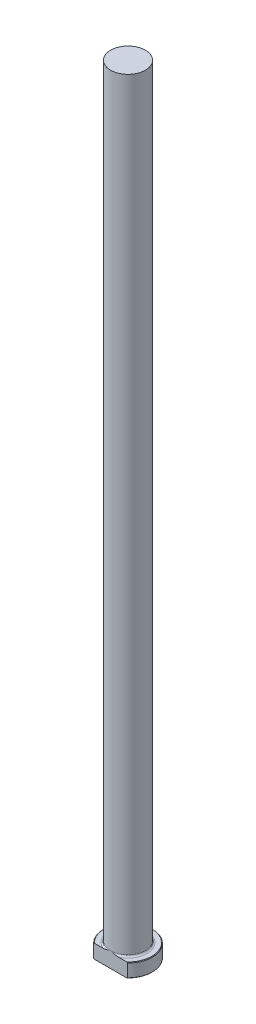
ISO-10303-21;
HEADER;
FILE_DESCRIPTION(('STEP AP214'),'2;1');
FILE_NAME('part.step','',(''),(''),'','','');
FILE_SCHEMA(('AUTOMOTIVE_DESIGN { 1 0 10303 214 1 1 1 1 }'));
ENDSEC;
DATA;
#1=APPLICATION_CONTEXT('core data for automotive mechanical design processes');
#2=APPLICATION_PROTOCOL_DEFINITION('international standard','automotive_design',2000,#1);
#3=PRODUCT_CONTEXT('',#1,'mechanical');
#4=PRODUCT('Part','Part','',(#3));
#5=PRODUCT_RELATED_PRODUCT_CATEGORY('part','',(#4));
#6=PRODUCT_DEFINITION_FORMATION('','',#4);
#7=PRODUCT_DEFINITION_CONTEXT('part definition',#1,'design');
#8=PRODUCT_DEFINITION('design','',#6,#7);
#9=PRODUCT_DEFINITION_SHAPE('','',#8);
#10=(LENGTH_UNIT() NAMED_UNIT(*) SI_UNIT(.MILLI.,.METRE.));
#11=(NAMED_UNIT(*) PLANE_ANGLE_UNIT() SI_UNIT($,.RADIAN.));
#12=(NAMED_UNIT(*) SI_UNIT($,.STERADIAN.) SOLID_ANGLE_UNIT());
#13=UNCERTAINTY_MEASURE_WITH_UNIT(LENGTH_MEASURE(1.E-05),#10,'distance_accuracy_value','');
#14=(GEOMETRIC_REPRESENTATION_CONTEXT(3) GLOBAL_UNCERTAINTY_ASSIGNED_CONTEXT((#13)) GLOBAL_UNIT_ASSIGNED_CONTEXT((#10,
#11,#12)) REPRESENTATION_CONTEXT('',''));
#15=CARTESIAN_POINT('',(0.,0.,0.));
#16=DIRECTION('',(0.,0.,1.));
#17=DIRECTION('',(1.,0.,0.));
#18=AXIS2_PLACEMENT_3D('',#15,#16,#17);
#19=CARTESIAN_POINT('',(0.,0.,0.));
#20=DIRECTION('',(0.,-1.,0.));
#21=DIRECTION('',(0.,0.,-1.));
#22=AXIS2_PLACEMENT_3D('',#19,#20,#21);
#23=PLANE('',#22);
#24=DIRECTION('',(1.,0.,0.));
#25=VECTOR('',#24,1.);
#26=CARTESIAN_POINT('',(-7.77712993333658,0.,7.93749999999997));
#27=LINE('',#26,#25);
#28=CARTESIAN_POINT('',(-7.40966369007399,0.,7.93749999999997));
#29=VERTEX_POINT('',#28);
#30=CARTESIAN_POINT('',(7.40966369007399,0.,7.93749999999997));
#31=VERTEX_POINT('',#30);
#32=EDGE_CURVE('E92',#29,#31,#27,.T.);
#33=ORIENTED_EDGE('',*,*,#32,.F.);
#34=CARTESIAN_POINT('',(0.,0.,0.));
#35=DIRECTION('',(0.,-1.,0.));
#36=DIRECTION('',(0.,0.,-1.));
#37=AXIS2_PLACEMENT_3D('',#34,#35,#36);
#38=CIRCLE('',#37,10.8585);
#39=EDGE_CURVE('E105',#29,#31,#38,.T.);
#40=ORIENTED_EDGE('',*,*,#39,.T.);
#41=EDGE_LOOP('',(#33,#40));
#42=FACE_BOUND('',#41,.T.);
#43=ADVANCED_FACE('F37',(#42),#23,.T.);
#44=CARTESIAN_POINT('',(0.,259.958771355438,0.));
#45=DIRECTION('',(0.,1.,0.));
#46=DIRECTION('',(0.,0.,1.));
#47=AXIS2_PLACEMENT_3D('',#44,#45,#46);
#48=CYLINDRICAL_SURFACE('',#47,11.1125);
#49=DIRECTION('',(0.,-1.,0.));
#50=VECTOR('',#49,1.);
#51=CARTESIAN_POINT('',(-7.77712993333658,355.6,7.93749999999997));
#52=LINE('',#51,#50);
#53=CARTESIAN_POINT('',(-7.77712993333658,6.09599999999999,7.93749999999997));
#54=VERTEX_POINT('',#53);
#55=CARTESIAN_POINT('',(-7.77712993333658,0.253999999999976,7.93749999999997));
#56=VERTEX_POINT('',#55);
#57=EDGE_CURVE('E95',#54,#56,#52,.T.);
#58=ORIENTED_EDGE('',*,*,#57,.F.);
#59=CARTESIAN_POINT('',(0.,6.09599999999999,0.));
#60=DIRECTION('',(0.,1.,0.));
#61=DIRECTION('',(0.,0.,1.));
#62=AXIS2_PLACEMENT_3D('',#59,#60,#61);
#63=CIRCLE('',#62,11.1125);
#64=CARTESIAN_POINT('',(7.77712993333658,6.09599999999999,7.93749999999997));
#65=VERTEX_POINT('',#64);
#66=EDGE_CURVE('E109',#54,#65,#63,.F.);
#67=ORIENTED_EDGE('',*,*,#66,.T.);
#68=DIRECTION('',(0.,-1.,0.));
#69=VECTOR('',#68,1.);
#70=CARTESIAN_POINT('',(7.77712993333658,355.6,7.93749999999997));
#71=LINE('',#70,#69);
#72=CARTESIAN_POINT('',(7.77712993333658,0.253999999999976,7.93749999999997));
#73=VERTEX_POINT('',#72);
#74=EDGE_CURVE('E187',#65,#73,#71,.T.);
#75=ORIENTED_EDGE('',*,*,#74,.T.);
#76=CARTESIAN_POINT('',(0.,0.253999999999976,0.));
#77=DIRECTION('',(0.,-1.,0.));
#78=DIRECTION('',(0.,0.,-1.));
#79=AXIS2_PLACEMENT_3D('',#76,#77,#78);
#80=CIRCLE('',#79,11.1125);
#81=EDGE_CURVE('E115',#73,#56,#80,.F.);
#82=ORIENTED_EDGE('',*,*,#81,.T.);
#83=EDGE_LOOP('',(#58,#67,#75,#82));
#84=FACE_BOUND('',#83,.T.);
#85=ADVANCED_FACE('F160',(#84),#48,.T.);
#86=CARTESIAN_POINT('',(-11.1125,6.35,0.));
#87=DIRECTION('',(0.,1.,0.));
#88=DIRECTION('',(0.,0.,1.));
#89=AXIS2_PLACEMENT_3D('',#86,#87,#88);
#90=PLANE('',#89);
#91=DIRECTION('',(-1.,0.,0.));
#92=VECTOR('',#91,1.);
#93=CARTESIAN_POINT('',(-11.1125,6.35,7.93749999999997));
#94=LINE('',#93,#92);
#95=CARTESIAN_POINT('',(7.40966369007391,6.35,7.93749999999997));
#96=VERTEX_POINT('',#95);
#97=CARTESIAN_POINT('',(3.56053282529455,6.35,7.93749999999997));
#98=VERTEX_POINT('',#97);
#99=EDGE_CURVE('E58',#96,#98,#94,.T.);
#100=ORIENTED_EDGE('',*,*,#99,.F.);
#101=CARTESIAN_POINT('',(0.,6.35,0.));
#102=DIRECTION('',(0.,1.,0.));
#103=DIRECTION('',(0.,0.,1.));
#104=AXIS2_PLACEMENT_3D('',#101,#102,#103);
#105=CIRCLE('',#104,10.8585);
#106=CARTESIAN_POINT('',(-7.40966369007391,6.35,7.93749999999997));
#107=VERTEX_POINT('',#106);
#108=EDGE_CURVE('E182',#96,#107,#105,.T.);
#109=ORIENTED_EDGE('',*,*,#108,.T.);
#110=CARTESIAN_POINT('',(-3.56053282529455,6.35000000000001,7.93749999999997));
#111=VERTEX_POINT('',#110);
#112=EDGE_CURVE('E140',#111,#107,#94,.T.);
#113=ORIENTED_EDGE('',*,*,#112,.F.);
#114=CARTESIAN_POINT('',(0.,6.35,0.));
#115=DIRECTION('',(0.,1.,0.));
#116=DIRECTION('',(0.,0.,1.));
#117=AXIS2_PLACEMENT_3D('',#114,#115,#116);
#118=CIRCLE('',#117,8.69949999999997);
#119=EDGE_CURVE('E112',#111,#98,#118,.F.);
#120=ORIENTED_EDGE('',*,*,#119,.T.);
#121=EDGE_LOOP('',(#100,#109,#113,#120));
#122=FACE_BOUND('',#121,.T.);
#123=ADVANCED_FACE('F164',(#122),#90,.T.);
#124=CARTESIAN_POINT('',(0.,259.958771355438,0.));
#125=DIRECTION('',(0.,1.,0.));
#126=DIRECTION('',(0.,0.,1.));
#127=AXIS2_PLACEMENT_3D('',#124,#125,#126);
#128=CYLINDRICAL_SURFACE('',#127,7.93749999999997);
#129=CARTESIAN_POINT('',(0.,7.11200000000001,0.));
#130=DIRECTION('',(0.,1.,0.));
#131=DIRECTION('',(0.,0.,1.));
#132=AXIS2_PLACEMENT_3D('',#129,#130,#131);
#133=CIRCLE('',#132,7.93749999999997);
#134=CARTESIAN_POINT('',(0.,7.11200000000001,7.93749999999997));
#135=VERTEX_POINT('',#134);
#136=EDGE_CURVE('E108',#135,#135,#133,.T.);
#137=ORIENTED_EDGE('',*,*,#136,.T.);
#138=EDGE_LOOP('',(#137));
#139=FACE_BOUND('',#138,.T.);
#140=CARTESIAN_POINT('',(0.,355.6,0.));
#141=DIRECTION('',(0.,1.,0.));
#142=DIRECTION('',(0.,0.,1.));
#143=AXIS2_PLACEMENT_3D('',#140,#141,#142);
#144=CIRCLE('',#143,7.93749999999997);
#145=CARTESIAN_POINT('',(0.,355.6,7.93749999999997));
#146=VERTEX_POINT('',#145);
#147=EDGE_CURVE('E100',#146,#146,#144,.T.);
#148=ORIENTED_EDGE('',*,*,#147,.F.);
#149=EDGE_LOOP('',(#148));
#150=FACE_BOUND('',#149,.T.);
#151=ADVANCED_FACE('F169',(#139,#150),#128,.T.);
#152=CARTESIAN_POINT('',(-7.93749999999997,355.6,0.));
#153=DIRECTION('',(0.,1.,0.));
#154=DIRECTION('',(0.,0.,1.));
#155=AXIS2_PLACEMENT_3D('',#152,#153,#154);
#156=PLANE('',#155);
#157=ORIENTED_EDGE('',*,*,#147,.T.);
#158=EDGE_LOOP('',(#157));
#159=FACE_BOUND('',#158,.T.);
#160=ADVANCED_FACE('F127',(#159),#156,.T.);
#161=CARTESIAN_POINT('',(0.,6.35000000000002,0.));
#162=DIRECTION('',(0.,-1.,0.));
#163=DIRECTION('',(0.,0.,-1.));
#164=AXIS2_PLACEMENT_3D('',#161,#162,#163);
#165=CONICAL_SURFACE('',#164,10.8584999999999,0.785398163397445);
#166=CARTESIAN_POINT('',(7.77782993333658,6.09551009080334,7.93749999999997));
#167=CARTESIAN_POINT('',(7.55686416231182,6.25010918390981,7.93749999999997));
#168=CARTESIAN_POINT('',(7.33434137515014,6.40253625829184,7.93749999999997));
#169=CARTESIAN_POINT('',(6.88555157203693,6.7020030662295,7.93749999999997));
#170=CARTESIAN_POINT('',(6.65928281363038,6.84904018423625,7.93749999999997));
#171=CARTESIAN_POINT('',(6.19963219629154,7.13839015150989,7.93749999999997));
#172=CARTESIAN_POINT('',(5.96619621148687,7.28061745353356,7.93749999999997));
#173=CARTESIAN_POINT('',(5.49446343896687,7.55674147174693,7.93749999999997));
#174=CARTESIAN_POINT('',(5.25616724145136,7.69063919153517,7.93749999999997));
#175=CARTESIAN_POINT('',(4.76752037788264,7.9516462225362,7.93749999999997));
#176=CARTESIAN_POINT('',(4.51701802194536,8.07847357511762,7.93749999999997));
#177=CARTESIAN_POINT('',(4.00950327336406,8.31861548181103,7.93749999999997));
#178=CARTESIAN_POINT('',(3.7524896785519,8.43192751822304,7.93749999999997));
#179=CARTESIAN_POINT('',(3.23293213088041,8.64114728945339,7.93749999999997));
#180=CARTESIAN_POINT('',(2.9704233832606,8.73714146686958,7.93749999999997));
#181=CARTESIAN_POINT('',(2.43885877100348,8.90857479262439,7.93749999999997));
#182=CARTESIAN_POINT('',(2.16980716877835,8.98402695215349,7.93749999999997));
#183=CARTESIAN_POINT('',(1.63948909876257,9.10734340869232,7.93749999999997));
#184=CARTESIAN_POINT('',(1.37850272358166,9.15639501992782,7.93749999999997));
#185=CARTESIAN_POINT('',(0.852916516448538,9.22954584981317,7.93749999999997));
#186=CARTESIAN_POINT('',(0.588315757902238,9.25363854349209,7.93749999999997));
#187=CARTESIAN_POINT('',(0.0615241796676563,9.27506688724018,7.93749999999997));
#188=CARTESIAN_POINT('',(-0.200652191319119,9.27275242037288,7.93749999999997));
#189=CARTESIAN_POINT('',(-0.723483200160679,9.24237186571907,7.93749999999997));
#190=CARTESIAN_POINT('',(-0.984137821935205,9.21430550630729,7.93749999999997));
#191=CARTESIAN_POINT('',(-1.49971239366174,9.13455414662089,7.93749999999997));
#192=CARTESIAN_POINT('',(-1.75466085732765,9.08305007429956,7.93749999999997));
#193=CARTESIAN_POINT('',(-2.25943125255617,8.95931831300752,7.93749999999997));
#194=CARTESIAN_POINT('',(-2.50925257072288,8.88708815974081,7.93749999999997));
#195=CARTESIAN_POINT('',(-3.00607435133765,8.72412572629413,7.93749999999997));
#196=CARTESIAN_POINT('',(-3.25300380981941,8.63317958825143,7.93749999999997));
#197=CARTESIAN_POINT('',(-3.74082952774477,8.43650564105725,7.93749999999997));
#198=CARTESIAN_POINT('',(-3.98172592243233,8.33077816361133,7.93749999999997));
#199=CARTESIAN_POINT('',(-4.5370759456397,8.07009959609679,7.93749999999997));
#200=CARTESIAN_POINT('',(-4.84932653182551,7.91047736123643,7.93749999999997));
#201=CARTESIAN_POINT('',(-5.4650687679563,7.57500459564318,7.93749999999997));
#202=CARTESIAN_POINT('',(-5.76855592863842,7.39914593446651,7.93749999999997));
#203=CARTESIAN_POINT('',(-6.3598067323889,7.04004732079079,7.93749999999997));
#204=CARTESIAN_POINT('',(-6.64777344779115,6.85713981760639,7.93749999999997));
#205=CARTESIAN_POINT('',(-7.0749988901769,6.57609320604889,7.93749999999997));
#206=CARTESIAN_POINT('',(-7.21652251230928,6.48136542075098,7.93749999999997));
#207=CARTESIAN_POINT('',(-7.49818193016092,6.28989246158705,7.93749999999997));
#208=CARTESIAN_POINT('',(-7.63831784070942,6.19314745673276,7.93749999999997));
#209=CARTESIAN_POINT('',(-7.77782993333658,6.09551009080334,7.93749999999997));
#210=B_SPLINE_CURVE_WITH_KNOTS('',3,(#166,#167,#168,#169,#170,#171,#172,#173,#174,#175,#176,
#177,#178,#179,#180,#181,#182,#183,#184,#185,#186,#187,#188,#189,#190,#191,#192,#193,#194,#195,
#196,#197,#198,#199,#200,#201,#202,#203,#204,#205,#206,#207,#208,#209),.UNSPECIFIED.,.F.,.F.,(4,
2,2,2,2,2,2,2,2,2,2,2,2,2,2,2,2,2,2,2,2,4),(0.,0.809069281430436,1.61852611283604,
2.43843783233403,3.2582505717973,4.10026020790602,4.94242645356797,5.7802650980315,
6.61757181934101,7.41315717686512,8.20895047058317,8.99421223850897,9.77948228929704,
10.5587906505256,11.3381917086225,12.1270494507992,12.9158894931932,13.9672755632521,
15.0191910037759,16.042396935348,16.5532851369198,17.0641307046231),.UNSPECIFIED.);
#211=EDGE_CURVE('E63',#65,#96,#210,.T.);
#212=ORIENTED_EDGE('',*,*,#211,.F.);
#213=ORIENTED_EDGE('',*,*,#66,.F.);
#214=EDGE_CURVE('E133',#107,#54,#210,.T.);
#215=ORIENTED_EDGE('',*,*,#214,.F.);
#216=ORIENTED_EDGE('',*,*,#108,.F.);
#217=EDGE_LOOP('',(#212,#213,#215,#216));
#218=FACE_BOUND('',#217,.T.);
#219=ADVANCED_FACE('F147',(#218),#165,.T.);
#220=CARTESIAN_POINT('',(0.,0.253999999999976,0.));
#221=DIRECTION('',(0.,1.,0.));
#222=DIRECTION('',(0.,0.,1.));
#223=AXIS2_PLACEMENT_3D('',#220,#221,#222);
#224=CONICAL_SURFACE('',#223,11.1125,0.78539816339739);
#225=CARTESIAN_POINT('',(-7.77782993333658,0.254489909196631,7.93749999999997));
#226=CARTESIAN_POINT('',(-7.55686416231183,0.0998908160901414,7.93749999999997));
#227=CARTESIAN_POINT('',(-7.33434137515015,-0.0525362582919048,7.93749999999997));
#228=CARTESIAN_POINT('',(-6.88555157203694,-0.352003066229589,7.93749999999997));
#229=CARTESIAN_POINT('',(-6.6592828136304,-0.499040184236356,7.93749999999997));
#230=CARTESIAN_POINT('',(-6.19963219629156,-0.78839015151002,7.93749999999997));
#231=CARTESIAN_POINT('',(-5.9661962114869,-0.93061745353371,7.93749999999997));
#232=CARTESIAN_POINT('',(-5.4944634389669,-1.2067414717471,7.93749999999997));
#233=CARTESIAN_POINT('',(-5.25616724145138,-1.34063919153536,7.93749999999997));
#234=CARTESIAN_POINT('',(-4.76752037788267,-1.60164622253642,7.93749999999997));
#235=CARTESIAN_POINT('',(-4.51701802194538,-1.72847357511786,7.93749999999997));
#236=CARTESIAN_POINT('',(-4.00950327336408,-1.96861548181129,7.93749999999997));
#237=CARTESIAN_POINT('',(-3.75248967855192,-2.08192751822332,7.93749999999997));
#238=CARTESIAN_POINT('',(-3.23293213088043,-2.2911472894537,7.93749999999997));
#239=CARTESIAN_POINT('',(-2.97042338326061,-2.3871414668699,7.93749999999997));
#240=CARTESIAN_POINT('',(-2.43885877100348,-2.55857479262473,7.93749999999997));
#241=CARTESIAN_POINT('',(-2.16980716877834,-2.63402695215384,7.93749999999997));
#242=CARTESIAN_POINT('',(-1.63948909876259,-2.75734340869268,7.93749999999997));
#243=CARTESIAN_POINT('',(-1.37850272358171,-2.80639501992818,7.93749999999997));
#244=CARTESIAN_POINT('',(-0.852916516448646,-2.87954584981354,7.93749999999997));
#245=CARTESIAN_POINT('',(-0.588315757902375,-2.90363854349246,7.93749999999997));
#246=CARTESIAN_POINT('',(-0.0615241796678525,-2.92506688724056,7.93749999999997));
#247=CARTESIAN_POINT('',(0.200652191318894,-2.92275242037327,7.93749999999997));
#248=CARTESIAN_POINT('',(0.723483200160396,-2.89237186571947,7.93749999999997));
#249=CARTESIAN_POINT('',(0.984137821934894,-2.8643055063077,7.93749999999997));
#250=CARTESIAN_POINT('',(1.49971239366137,-2.78455414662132,7.93749999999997));
#251=CARTESIAN_POINT('',(1.75466085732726,-2.7330500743,7.93749999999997));
#252=CARTESIAN_POINT('',(2.25943125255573,-2.60931831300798,7.93749999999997));
#253=CARTESIAN_POINT('',(2.50925257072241,-2.53708815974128,7.93749999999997));
#254=CARTESIAN_POINT('',(3.00607435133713,-2.37412572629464,7.93749999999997));
#255=CARTESIAN_POINT('',(3.25300380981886,-2.28317958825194,7.93749999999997));
#256=CARTESIAN_POINT('',(3.74082952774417,-2.0865056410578,7.93749999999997));
#257=CARTESIAN_POINT('',(3.98172592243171,-1.98077816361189,7.93749999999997));
#258=CARTESIAN_POINT('',(4.53707594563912,-1.72009959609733,7.93749999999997));
#259=CARTESIAN_POINT('',(4.849326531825,-1.56047736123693,7.93749999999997));
#260=CARTESIAN_POINT('',(5.4650687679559,-1.2250045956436,7.93749999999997));
#261=CARTESIAN_POINT('',(5.76855592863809,-1.04914593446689,7.93749999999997));
#262=CARTESIAN_POINT('',(6.35980673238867,-0.690047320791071,7.93749999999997));
#263=CARTESIAN_POINT('',(6.64777344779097,-0.507139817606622,7.93749999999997));
#264=CARTESIAN_POINT('',(7.07499889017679,-0.22609320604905,7.93749999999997));
#265=CARTESIAN_POINT('',(7.21652251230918,-0.13136542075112,7.93749999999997));
#266=CARTESIAN_POINT('',(7.49818193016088,0.0601075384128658,7.93749999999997));
#267=CARTESIAN_POINT('',(7.6383178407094,0.156852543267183,7.93749999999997));
#268=CARTESIAN_POINT('',(7.77782993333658,0.254489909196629,7.93749999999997));
#269=B_SPLINE_CURVE_WITH_KNOTS('',3,(#225,#226,#227,#228,#229,#230,#231,#232,#233,#234,#235,
#236,#237,#238,#239,#240,#241,#242,#243,#244,#245,#246,#247,#248,#249,#250,#251,#252,#253,#254,
#255,#256,#257,#258,#259,#260,#261,#262,#263,#264,#265,#266,#267,#268),.UNSPECIFIED.,.F.,.F.,(4,
2,2,2,2,2,2,2,2,2,2,2,2,2,2,2,2,2,2,2,2,4),(0.,0.809069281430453,1.61852611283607,
2.43843783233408,3.25825057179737,4.10026020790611,4.94242645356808,5.78026509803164,
6.61757181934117,7.41315717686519,8.20895047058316,8.99421223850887,9.77948228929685,
10.5587906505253,11.3381917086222,12.1270494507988,12.9158894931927,13.9672755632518,
15.0191910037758,16.0423969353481,16.55328513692,17.0641307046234),.UNSPECIFIED.);
#270=EDGE_CURVE('E89',#56,#29,#269,.T.);
#271=ORIENTED_EDGE('',*,*,#270,.F.);
#272=ORIENTED_EDGE('',*,*,#81,.F.);
#273=EDGE_CURVE('E101',#31,#73,#269,.T.);
#274=ORIENTED_EDGE('',*,*,#273,.F.);
#275=ORIENTED_EDGE('',*,*,#39,.F.);
#276=EDGE_LOOP('',(#271,#272,#274,#275));
#277=FACE_BOUND('',#276,.T.);
#278=ADVANCED_FACE('F107',(#277),#224,.T.);
#279=CARTESIAN_POINT('',(0.,7.11200000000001,0.));
#280=DIRECTION('',(0.,1.,0.));
#281=DIRECTION('',(0.,0.,1.));
#282=AXIS2_PLACEMENT_3D('',#279,#280,#281);
#283=TOROIDAL_SURFACE('',#282,8.69949999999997,0.762);
#284=ORIENTED_EDGE('',*,*,#119,.F.);
#285=CARTESIAN_POINT('',(0.,7.11200000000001,7.93749999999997));
#286=CARTESIAN_POINT('',(1.13258152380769E-10,7.11200098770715,7.93749999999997));
#287=CARTESIAN_POINT('',(-2.94116963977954E-07,7.11200197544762,7.93749999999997));
#288=CARTESIAN_POINT('',(-1.16076455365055E-06,7.11200384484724,7.93749999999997));
#289=CARTESIAN_POINT('',(-1.74846185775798E-06,7.11200471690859,7.93749999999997));
#290=CARTESIAN_POINT('',(-3.15168242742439E-06,7.11200648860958,7.93749999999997));
#291=CARTESIAN_POINT('',(-3.98838294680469E-06,7.11200737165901,7.93749999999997));
#292=CARTESIAN_POINT('',(-5.75414916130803E-06,7.11200899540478,7.93749999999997));
#293=CARTESIAN_POINT('',(-6.68112169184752E-06,7.11200973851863,7.93749999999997));
#294=CARTESIAN_POINT('',(-1.01485822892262E-05,7.11201237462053,7.93749999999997));
#295=CARTESIAN_POINT('',(-1.28042082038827E-05,7.11201412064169,7.93749999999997));
#296=CARTESIAN_POINT('',(-1.81630822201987E-05,7.11201710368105,7.93749999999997));
#297=CARTESIAN_POINT('',(-2.08532201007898E-05,7.1120183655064,7.93749999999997));
#298=CARTESIAN_POINT('',(-3.18657482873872E-05,7.1120234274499,7.93749999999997));
#299=CARTESIAN_POINT('',(-4.02765822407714E-05,7.11202705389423,7.93749999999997));
#300=CARTESIAN_POINT('',(-5.64375980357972E-05,7.11203261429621,7.93749999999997));
#301=CARTESIAN_POINT('',(-6.41339918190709E-05,7.1120347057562,7.93749999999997));
#302=CARTESIAN_POINT('',(-0.000120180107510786,7.11204956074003,7.93749999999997));
#303=CARTESIAN_POINT('',(-0.000168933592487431,7.11206045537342,7.93749999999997));
#304=CARTESIAN_POINT('',(-0.000360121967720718,7.11210809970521,7.93749999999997));
#305=CARTESIAN_POINT('',(-0.000500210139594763,7.11215390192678,7.93749999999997));
#306=CARTESIAN_POINT('',(-0.00105170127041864,7.11233078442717,7.93749999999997));
#307=CARTESIAN_POINT('',(-0.00146451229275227,7.11245570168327,7.93749999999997));
#308=CARTESIAN_POINT('',(-0.00309439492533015,7.1129530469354,7.93749999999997));
#309=CARTESIAN_POINT('',(-0.00430970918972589,7.11333301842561,7.93749999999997));
#310=CARTESIAN_POINT('',(-0.00935535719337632,7.11490592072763,7.93749999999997));
#311=CARTESIAN_POINT('',(-0.0131878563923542,7.11608956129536,7.93749999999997));
#312=CARTESIAN_POINT('',(-0.0841146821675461,7.13800088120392,7.93749999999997));
#313=CARTESIAN_POINT('',(-0.151187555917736,7.15882206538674,7.93749999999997));
#314=CARTESIAN_POINT('',(-0.282710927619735,7.1994724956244,7.93749999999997));
#315=CARTESIAN_POINT('',(-0.347159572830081,7.2193082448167,7.93749999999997));
#316=CARTESIAN_POINT('',(-0.484183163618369,7.26126494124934,7.93749999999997));
#317=CARTESIAN_POINT('',(-0.556765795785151,7.28336123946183,7.93749999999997));
#318=CARTESIAN_POINT('',(-0.702843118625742,7.32740310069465,7.93749999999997));
#319=CARTESIAN_POINT('',(-0.77633910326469,7.34934437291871,7.93749999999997));
#320=CARTESIAN_POINT('',(-0.902891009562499,7.38662160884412,7.93749999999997));
#321=CARTESIAN_POINT('',(-0.955908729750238,7.40208704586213,7.93749999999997));
#322=CARTESIAN_POINT('',(-1.06190505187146,7.4326430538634,7.93749999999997));
#323=CARTESIAN_POINT('',(-1.1148834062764,7.44773448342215,7.93749999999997));
#324=CARTESIAN_POINT('',(-1.27145845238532,7.49171323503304,7.93749999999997));
#325=CARTESIAN_POINT('',(-1.37521028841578,7.52005117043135,7.93749999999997));
#326=CARTESIAN_POINT('',(-1.61238875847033,7.58245782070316,7.93749999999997));
#327=CARTESIAN_POINT('',(-1.74598056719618,7.61590602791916,7.93749999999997));
#328=CARTESIAN_POINT('',(-2.01520265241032,7.67878699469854,7.93749999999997));
#329=CARTESIAN_POINT('',(-2.15084070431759,7.70818682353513,7.93749999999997));
#330=CARTESIAN_POINT('',(-2.43325292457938,7.76331762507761,7.93749999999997));
#331=CARTESIAN_POINT('',(-2.58011275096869,7.7886200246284,7.93749999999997));
#332=CARTESIAN_POINT('',(-2.87472585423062,7.83067454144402,7.93749999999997));
#333=CARTESIAN_POINT('',(-3.02247613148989,7.84744708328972,7.93749999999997));
#334=CARTESIAN_POINT('',(-3.31060630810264,7.86923610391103,7.93749999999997));
#335=CARTESIAN_POINT('',(-3.45093460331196,7.87485939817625,7.93749999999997));
#336=CARTESIAN_POINT('',(-3.66050189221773,7.87341982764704,7.93749999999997));
#337=CARTESIAN_POINT('',(-3.72977927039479,7.87133675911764,7.93749999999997));
#338=CARTESIAN_POINT('',(-3.86811371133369,7.86341207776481,7.93749999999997));
#339=CARTESIAN_POINT('',(-3.93717083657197,7.85757164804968,7.93749999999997));
#340=CARTESIAN_POINT('',(-4.06041254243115,7.84314460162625,7.93749999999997));
#341=CARTESIAN_POINT('',(-4.11469322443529,7.83538548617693,7.93749999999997));
#342=CARTESIAN_POINT('',(-4.22269673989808,7.81667130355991,7.93749999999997));
#343=CARTESIAN_POINT('',(-4.27641972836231,7.8057171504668,7.93749999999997));
#344=CARTESIAN_POINT('',(-4.38294358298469,7.78009016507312,7.93749999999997));
#345=CARTESIAN_POINT('',(-4.43574509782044,7.76542007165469,7.93749999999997));
#346=CARTESIAN_POINT('',(-4.5399035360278,7.73168797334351,7.93749999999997));
#347=CARTESIAN_POINT('',(-4.59126184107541,7.7126303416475,7.93749999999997));
#348=CARTESIAN_POINT('',(-4.68243097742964,7.67324353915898,7.93749999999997));
#349=CARTESIAN_POINT('',(-4.72262101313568,7.65380111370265,7.93749999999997));
#350=CARTESIAN_POINT('',(-4.80081729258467,7.61075795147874,7.93749999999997));
#351=CARTESIAN_POINT('',(-4.83882094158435,7.5871524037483,7.93749999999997));
#352=CARTESIAN_POINT('',(-4.91185697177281,7.53476777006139,7.93749999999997));
#353=CARTESIAN_POINT('',(-4.94684723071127,7.50592882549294,7.93749999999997));
#354=CARTESIAN_POINT('',(-5.01124850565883,7.44256359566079,7.93749999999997));
#355=CARTESIAN_POINT('',(-5.04068010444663,7.40805921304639,7.93749999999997));
#356=CARTESIAN_POINT('',(-5.08050372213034,7.34868448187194,7.93749999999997));
#357=CARTESIAN_POINT('',(-5.0937376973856,7.32572520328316,7.93749999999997));
#358=CARTESIAN_POINT('',(-5.11643276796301,7.27799728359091,7.93749999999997));
#359=CARTESIAN_POINT('',(-5.12589708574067,7.2532302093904,7.93749999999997));
#360=CARTESIAN_POINT('',(-5.14035194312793,7.20217121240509,7.93749999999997));
#361=CARTESIAN_POINT('',(-5.14530427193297,7.17586823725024,7.93749999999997));
#362=CARTESIAN_POINT('',(-5.15008487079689,7.12280054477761,7.93749999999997));
#363=CARTESIAN_POINT('',(-5.14991589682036,7.096036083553,7.93749999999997));
#364=CARTESIAN_POINT('',(-5.14478044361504,7.04592288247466,7.93749999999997));
#365=CARTESIAN_POINT('',(-5.14033553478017,7.02251814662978,7.93749999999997));
#366=CARTESIAN_POINT('',(-5.12776595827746,6.97672688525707,7.93749999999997));
#367=CARTESIAN_POINT('',(-5.11963963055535,6.95434082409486,7.93749999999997));
#368=CARTESIAN_POINT('',(-5.09700432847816,6.90374425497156,7.93749999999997));
#369=CARTESIAN_POINT('',(-5.08127026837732,6.87608398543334,7.93749999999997));
#370=CARTESIAN_POINT('',(-5.04556418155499,6.82365182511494,7.93749999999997));
#371=CARTESIAN_POINT('',(-5.02558286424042,6.79888645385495,7.93749999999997));
#372=CARTESIAN_POINT('',(-4.97125379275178,6.74000253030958,7.93749999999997));
#373=CARTESIAN_POINT('',(-4.93486414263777,6.70778219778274,7.93749999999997));
#374=CARTESIAN_POINT('',(-4.85771872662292,6.64922291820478,7.93749999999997));
#375=CARTESIAN_POINT('',(-4.81695725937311,6.62289179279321,7.93749999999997));
#376=CARTESIAN_POINT('',(-4.73720517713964,6.57773800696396,7.93749999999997));
#377=CARTESIAN_POINT('',(-4.69849365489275,6.5584128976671,7.93749999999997));
#378=CARTESIAN_POINT('',(-4.61954917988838,6.5231323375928,7.93749999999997));
#379=CARTESIAN_POINT('',(-4.57931497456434,6.50717973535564,7.93749999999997));
#380=CARTESIAN_POINT('',(-4.45647143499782,6.46345758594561,7.93749999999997));
#381=CARTESIAN_POINT('',(-4.37228494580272,6.44011987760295,7.93749999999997));
#382=CARTESIAN_POINT('',(-4.19880968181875,6.4017233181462,7.93749999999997));
#383=CARTESIAN_POINT('',(-4.10944883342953,6.38701466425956,7.93749999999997));
#384=CARTESIAN_POINT('',(-3.92966045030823,6.36518873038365,7.93749999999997));
#385=CARTESIAN_POINT('',(-3.83923113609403,6.35808673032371,7.93749999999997));
#386=CARTESIAN_POINT('',(-3.66108493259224,6.35019088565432,7.93749999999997));
#387=CARTESIAN_POINT('',(-3.57337577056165,6.34919885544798,7.93749999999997));
#388=CARTESIAN_POINT('',(-3.39842026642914,6.35200478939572,7.93749999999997));
#389=CARTESIAN_POINT('',(-3.31117353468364,6.35578253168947,7.93749999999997));
#390=CARTESIAN_POINT('',(-3.10624349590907,6.36936667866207,7.93749999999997));
#391=CARTESIAN_POINT('',(-2.98867206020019,6.38082875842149,7.93749999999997));
#392=CARTESIAN_POINT('',(-2.75430549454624,6.40959217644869,7.93749999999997));
#393=CARTESIAN_POINT('',(-2.63751016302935,6.42689193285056,7.93749999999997));
#394=CARTESIAN_POINT('',(-2.40203457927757,6.46665897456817,7.93749999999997));
#395=CARTESIAN_POINT('',(-2.28337321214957,6.48923652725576,7.93749999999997));
#396=CARTESIAN_POINT('',(-2.0465823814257,6.53840461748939,7.93749999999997));
#397=CARTESIAN_POINT('',(-1.92845502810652,6.5650051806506,7.93749999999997));
#398=CARTESIAN_POINT('',(-1.6507512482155,6.63144067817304,7.93749999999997));
#399=CARTESIAN_POINT('',(-1.49149431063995,6.67260177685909,7.93749999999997));
#400=CARTESIAN_POINT('',(-1.17583354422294,6.75847009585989,7.93749999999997));
#401=CARTESIAN_POINT('',(-1.01941758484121,6.80313344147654,7.93749999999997));
#402=CARTESIAN_POINT('',(-0.794236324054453,6.86935337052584,7.93749999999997));
#403=CARTESIAN_POINT('',(-0.725177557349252,6.88992364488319,7.93749999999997));
#404=CARTESIAN_POINT('',(-0.586877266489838,6.93151983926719,7.93749999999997));
#405=CARTESIAN_POINT('',(-0.517636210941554,6.95254732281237,7.93749999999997));
#406=CARTESIAN_POINT('',(-0.375904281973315,6.99585156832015,7.93749999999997));
#407=CARTESIAN_POINT('',(-0.303416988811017,7.01813983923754,7.93749999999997));
#408=CARTESIAN_POINT('',(-0.159634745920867,7.06256277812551,7.93749999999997));
#409=CARTESIAN_POINT('',(-0.0883389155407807,7.08469437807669,7.93749999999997));
#410=CARTESIAN_POINT('',(-0.0131844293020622,7.10791148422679,7.93749999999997));
#411=CARTESIAN_POINT('',(-0.00934850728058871,7.10909618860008,7.93749999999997));
#412=CARTESIAN_POINT('',(-0.00430206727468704,7.11066934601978,7.93749999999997));
#413=CARTESIAN_POINT('',(-0.0030893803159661,7.1110484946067,7.93749999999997));
#414=CARTESIAN_POINT('',(-0.00146278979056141,7.11154483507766,7.93749999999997));
#415=CARTESIAN_POINT('',(-0.00105063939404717,7.11166955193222,7.93749999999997));
#416=CARTESIAN_POINT('',(-0.000499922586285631,7.11184619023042,7.93749999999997));
#417=CARTESIAN_POINT('',(-0.000359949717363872,7.11189195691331,7.93749999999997));
#418=CARTESIAN_POINT('',(-0.000168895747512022,7.11193956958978,7.93749999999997));
#419=CARTESIAN_POINT('',(-0.000120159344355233,7.11195046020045,7.93749999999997));
#420=CARTESIAN_POINT('',(-6.41304538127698E-05,7.11196530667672,7.93749999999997));
#421=CARTESIAN_POINT('',(-5.64350941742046E-05,7.11196739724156,7.93749999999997));
#422=CARTESIAN_POINT('',(-4.02761206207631E-05,7.1119729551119,7.93749999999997));
#423=CARTESIAN_POINT('',(-3.18662417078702E-05,7.11197657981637,7.93749999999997));
#424=CARTESIAN_POINT('',(-2.08546748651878E-05,7.111981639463,7.93749999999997));
#425=CARTESIAN_POINT('',(-1.81646141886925E-05,7.11198290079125,7.93749999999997));
#426=CARTESIAN_POINT('',(-1.28058054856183E-05,7.11198588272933,7.93749999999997));
#427=CARTESIAN_POINT('',(-1.01501596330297E-05,7.11198762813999,7.93749999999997));
#428=CARTESIAN_POINT('',(-6.68256608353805E-06,7.1119902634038,7.93749999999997));
#429=CARTESIAN_POINT('',(-5.75553210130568E-06,7.11199100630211,7.93749999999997));
#430=CARTESIAN_POINT('',(-3.98960414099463E-06,7.11199262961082,7.93749999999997));
#431=CARTESIAN_POINT('',(-3.15280241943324E-06,7.11199351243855,7.93749999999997));
#432=CARTESIAN_POINT('',(-1.74934054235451E-06,7.11199528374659,7.93749999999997));
#433=CARTESIAN_POINT('',(-1.16151054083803E-06,7.11199615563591,7.93749999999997));
#434=CARTESIAN_POINT('',(-2.9453442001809E-07,7.11199802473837,7.93749999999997));
#435=CARTESIAN_POINT('',(-1.1325131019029E-10,7.11199901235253,7.93749999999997));
#436=CARTESIAN_POINT('',(0.,7.11200000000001,7.93749999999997));
#437=B_SPLINE_CURVE_WITH_KNOTS('',3,(#285,#286,#287,#288,#289,#290,#291,#292,#293,#294,#295,
#296,#297,#298,#299,#300,#301,#302,#303,#304,#305,#306,#307,#308,#309,#310,#311,#312,#313,#314,
#315,#316,#317,#318,#319,#320,#321,#322,#323,#324,#325,#326,#327,#328,#329,#330,#331,#332,#333,
#334,#335,#336,#337,#338,#339,#340,#341,#342,#343,#344,#345,#346,#347,#348,#349,#350,#351,#352,
#353,#354,#355,#356,#357,#358,#359,#360,#361,#362,#363,#364,#365,#366,#367,#368,#369,#370,#371,
#372,#373,#374,#375,#376,#377,#378,#379,#380,#381,#382,#383,#384,#385,#386,#387,#388,#389,#390,
#391,#392,#393,#394,#395,#396,#397,#398,#399,#400,#401,#402,#403,#404,#405,#406,#407,#408,#409,
#410,#411,#412,#413,#414,#415,#416,#417,#418,#419,#420,#421,#422,#423,#424,#425,#426,#427,#428,
#429,#430,#431,#432,#433,#434,#435,#436),.UNSPECIFIED.,.T.,.F.,(4,2,2,2,2,2,2,2,2,2,2,2,2,2,2,2,
2,2,2,2,2,2,2,2,2,2,2,2,2,2,2,2,2,2,2,2,2,2,2,2,2,2,2,2,2,2,2,2,2,2,2,2,2,2,2,2,2,2,2,2,2,2,2,2,
2,2,2,2,2,2,2,2,2,2,2,4),(0.,2.97091136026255E-06,6.11577848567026E-06,9.74697906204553E-06,
1.33081308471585E-05,2.28024387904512E-05,3.17093749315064E-05,5.91235364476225E-05,
8.30186327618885E-05,0.000232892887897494,0.000674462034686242,0.00196893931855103,
0.00578821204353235,0.0178223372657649,0.228503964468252,0.430802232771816,0.658415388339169,
0.888517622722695,1.05419863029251,1.21945534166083,1.54209895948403,1.95519189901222,
2.37146826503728,2.81834547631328,3.26414755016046,3.6849361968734,3.89278379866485,
4.10056598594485,4.26498450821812,4.42935603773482,4.59360676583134,4.75769448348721,
4.89144050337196,5.02534210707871,5.1608847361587,5.29591518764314,5.37514552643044,
5.45430798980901,5.53413479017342,5.61391863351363,5.68506157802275,5.7562366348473,
5.85117093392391,5.94631507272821,6.09131078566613,6.23649794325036,6.36611054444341,
6.49583218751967,6.7571662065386,7.02848031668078,7.30033841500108,7.56332987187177,
7.82521008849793,8.17940150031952,8.53349701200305,8.89578256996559,9.25898631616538,
9.75237330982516,10.2403455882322,10.4565169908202,10.673606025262,10.9011178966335,
11.1250637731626,11.1371086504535,11.1409196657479,11.1422120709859,11.1426532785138,
11.1428031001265,11.1428269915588,11.1428544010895,11.1428633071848,11.142872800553,
11.1428763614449,11.1428799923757,11.1428831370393,11.1428861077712),.UNSPECIFIED.);
#438=EDGE_CURVE('E11',#111,#135,#437,.T.);
#439=ORIENTED_EDGE('',*,*,#438,.T.);
#440=ORIENTED_EDGE('',*,*,#136,.F.);
#441=CARTESIAN_POINT('',(0.,7.11200000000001,7.93749999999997));
#442=CARTESIAN_POINT('',(-1.1325831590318E-10,7.11199901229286,7.93749999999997));
#443=CARTESIAN_POINT('',(2.94116963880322E-07,7.11199802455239,7.93749999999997));
#444=CARTESIAN_POINT('',(1.16076455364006E-06,7.11199615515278,7.93749999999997));
#445=CARTESIAN_POINT('',(1.74846185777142E-06,7.11199528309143,7.93749999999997));
#446=CARTESIAN_POINT('',(3.15168242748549E-06,7.11199351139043,7.93749999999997));
#447=CARTESIAN_POINT('',(3.98838294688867E-06,7.11199262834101,7.93749999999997));
#448=CARTESIAN_POINT('',(5.75414916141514E-06,7.11199100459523,7.93749999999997));
#449=CARTESIAN_POINT('',(6.68112169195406E-06,7.11199026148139,7.93749999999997));
#450=CARTESIAN_POINT('',(1.01485822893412E-05,7.11198762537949,7.93749999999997));
#451=CARTESIAN_POINT('',(1.28042082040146E-05,7.11198587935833,7.93749999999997));
#452=CARTESIAN_POINT('',(1.81630822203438E-05,7.11198289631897,7.93749999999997));
#453=CARTESIAN_POINT('',(2.0853220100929E-05,7.11198163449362,7.93749999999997));
#454=CARTESIAN_POINT('',(3.18657482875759E-05,7.11197657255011,7.93749999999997));
#455=CARTESIAN_POINT('',(4.02765822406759E-05,7.11197294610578,7.93749999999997));
#456=CARTESIAN_POINT('',(5.6437598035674E-05,7.11196738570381,7.93749999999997));
#457=CARTESIAN_POINT('',(6.41339918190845E-05,7.11196529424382,7.93749999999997));
#458=CARTESIAN_POINT('',(0.000120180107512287,7.11195043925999,7.93749999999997));
#459=CARTESIAN_POINT('',(0.000168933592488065,7.1119395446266,7.93749999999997));
#460=CARTESIAN_POINT('',(0.000360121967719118,7.1118919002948,7.93749999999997));
#461=CARTESIAN_POINT('',(0.000500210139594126,7.11184609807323,7.93749999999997));
#462=CARTESIAN_POINT('',(0.00105170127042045,7.11166921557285,7.93749999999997));
#463=CARTESIAN_POINT('',(0.00146451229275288,7.11154429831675,7.93749999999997));
#464=CARTESIAN_POINT('',(0.00309439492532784,7.11104695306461,7.93749999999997));
#465=CARTESIAN_POINT('',(0.00430970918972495,7.1106669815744,7.93749999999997));
#466=CARTESIAN_POINT('',(0.00935535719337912,7.1090940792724,7.93749999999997));
#467=CARTESIAN_POINT('',(0.0131878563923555,7.10791043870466,7.93749999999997));
#468=CARTESIAN_POINT('',(0.0841146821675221,7.08599911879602,7.93749999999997));
#469=CARTESIAN_POINT('',(0.151187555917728,7.06517793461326,7.93749999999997));
#470=CARTESIAN_POINT('',(0.282710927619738,7.02452750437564,7.93749999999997));
#471=CARTESIAN_POINT('',(0.347159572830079,7.00469175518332,7.93749999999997));
#472=CARTESIAN_POINT('',(0.484183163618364,6.96273505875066,7.93749999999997));
#473=CARTESIAN_POINT('',(0.556765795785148,6.94063876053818,7.93749999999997));
#474=CARTESIAN_POINT('',(0.702843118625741,6.89659689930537,7.93749999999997));
#475=CARTESIAN_POINT('',(0.77633910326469,6.87465562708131,7.93749999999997));
#476=CARTESIAN_POINT('',(0.902891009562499,6.8373783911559,7.93749999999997));
#477=CARTESIAN_POINT('',(0.955908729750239,6.82191295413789,7.93749999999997));
#478=CARTESIAN_POINT('',(1.06190505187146,6.79135694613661,7.93749999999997));
#479=CARTESIAN_POINT('',(1.11488340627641,6.77626551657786,7.93749999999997));
#480=CARTESIAN_POINT('',(1.27145845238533,6.73228676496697,7.93749999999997));
#481=CARTESIAN_POINT('',(1.37521028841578,6.70394882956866,7.93749999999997));
#482=CARTESIAN_POINT('',(1.61238875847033,6.64154217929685,7.93749999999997));
#483=CARTESIAN_POINT('',(1.74598056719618,6.60809397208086,7.93749999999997));
#484=CARTESIAN_POINT('',(2.01520265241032,6.54521300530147,7.93749999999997));
#485=CARTESIAN_POINT('',(2.15084070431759,6.51581317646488,7.93749999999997));
#486=CARTESIAN_POINT('',(2.43325292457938,6.46068237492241,7.93749999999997));
#487=CARTESIAN_POINT('',(2.58011275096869,6.43537997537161,7.93749999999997));
#488=CARTESIAN_POINT('',(2.87472585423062,6.393325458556,7.93749999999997));
#489=CARTESIAN_POINT('',(3.02247613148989,6.3765529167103,7.93749999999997));
#490=CARTESIAN_POINT('',(3.31060630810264,6.35476389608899,7.93749999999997));
#491=CARTESIAN_POINT('',(3.45093460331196,6.34914060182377,7.93749999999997));
#492=CARTESIAN_POINT('',(3.66050189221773,6.35058017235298,7.93749999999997));
#493=CARTESIAN_POINT('',(3.72977927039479,6.35266324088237,7.93749999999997));
#494=CARTESIAN_POINT('',(3.86811371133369,6.36058792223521,7.93749999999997));
#495=CARTESIAN_POINT('',(3.93717083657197,6.36642835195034,7.93749999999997));
#496=CARTESIAN_POINT('',(4.06041254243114,6.38085539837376,7.93749999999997));
#497=CARTESIAN_POINT('',(4.11469322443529,6.38861451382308,7.93749999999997));
#498=CARTESIAN_POINT('',(4.22269673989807,6.40732869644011,7.93749999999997));
#499=CARTESIAN_POINT('',(4.27641972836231,6.41828284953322,7.93749999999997));
#500=CARTESIAN_POINT('',(4.38294358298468,6.44390983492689,7.93749999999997));
#501=CARTESIAN_POINT('',(4.43574509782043,6.45857992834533,7.93749999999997));
#502=CARTESIAN_POINT('',(4.5399035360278,6.4923120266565,7.93749999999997));
#503=CARTESIAN_POINT('',(4.59126184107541,6.51136965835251,7.93749999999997));
#504=CARTESIAN_POINT('',(4.68243097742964,6.55075646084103,7.93749999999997));
#505=CARTESIAN_POINT('',(4.72262101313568,6.57019888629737,7.93749999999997));
#506=CARTESIAN_POINT('',(4.80081729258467,6.61324204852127,7.93749999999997));
#507=CARTESIAN_POINT('',(4.83882094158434,6.63684759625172,7.93749999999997));
#508=CARTESIAN_POINT('',(4.91185697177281,6.68923222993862,7.93749999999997));
#509=CARTESIAN_POINT('',(4.94684723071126,6.71807117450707,7.93749999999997));
#510=CARTESIAN_POINT('',(5.01124850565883,6.78143640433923,7.93749999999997));
#511=CARTESIAN_POINT('',(5.04068010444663,6.81594078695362,7.93749999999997));
#512=CARTESIAN_POINT('',(5.08050372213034,6.87531551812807,7.93749999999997));
#513=CARTESIAN_POINT('',(5.09373769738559,6.89827479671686,7.93749999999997));
#514=CARTESIAN_POINT('',(5.11643276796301,6.94600271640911,7.93749999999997));
#515=CARTESIAN_POINT('',(5.12589708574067,6.97076979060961,7.93749999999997));
#516=CARTESIAN_POINT('',(5.14035194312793,7.02182878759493,7.93749999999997));
#517=CARTESIAN_POINT('',(5.14530427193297,7.04813176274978,7.93749999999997));
#518=CARTESIAN_POINT('',(5.15008487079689,7.1011994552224,7.93749999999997));
#519=CARTESIAN_POINT('',(5.14991589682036,7.12796391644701,7.93749999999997));
#520=CARTESIAN_POINT('',(5.14478044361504,7.17807711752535,7.93749999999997));
#521=CARTESIAN_POINT('',(5.14033553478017,7.20148185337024,7.93749999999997));
#522=CARTESIAN_POINT('',(5.12776595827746,7.24727311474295,7.93749999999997));
#523=CARTESIAN_POINT('',(5.11963963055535,7.26965917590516,7.93749999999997));
#524=CARTESIAN_POINT('',(5.09700432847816,7.32025574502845,7.93749999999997));
#525=CARTESIAN_POINT('',(5.08127026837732,7.34791601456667,7.93749999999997));
#526=CARTESIAN_POINT('',(5.04556418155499,7.40034817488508,7.93749999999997));
#527=CARTESIAN_POINT('',(5.02558286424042,7.42511354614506,7.93749999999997));
#528=CARTESIAN_POINT('',(4.97125379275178,7.48399746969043,7.93749999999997));
#529=CARTESIAN_POINT('',(4.93486414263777,7.51621780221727,7.93749999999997));
#530=CARTESIAN_POINT('',(4.85771872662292,7.57477708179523,7.93749999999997));
#531=CARTESIAN_POINT('',(4.81695725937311,7.6011082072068,7.93749999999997));
#532=CARTESIAN_POINT('',(4.73720517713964,7.64626199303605,7.93749999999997));
#533=CARTESIAN_POINT('',(4.69849365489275,7.66558710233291,7.93749999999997));
#534=CARTESIAN_POINT('',(4.61954917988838,7.70086766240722,7.93749999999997));
#535=CARTESIAN_POINT('',(4.57931497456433,7.71682026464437,7.93749999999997));
#536=CARTESIAN_POINT('',(4.45647143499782,7.7605424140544,7.93749999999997));
#537=CARTESIAN_POINT('',(4.37228494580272,7.78388012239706,7.93749999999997));
#538=CARTESIAN_POINT('',(4.19880968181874,7.82227668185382,7.93749999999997));
#539=CARTESIAN_POINT('',(4.10944883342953,7.83698533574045,7.93749999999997));
#540=CARTESIAN_POINT('',(3.92966045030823,7.85881126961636,7.93749999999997));
#541=CARTESIAN_POINT('',(3.83923113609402,7.86591326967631,7.93749999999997));
#542=CARTESIAN_POINT('',(3.66108493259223,7.8738091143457,7.93749999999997));
#543=CARTESIAN_POINT('',(3.57337577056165,7.87480114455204,7.93749999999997));
#544=CARTESIAN_POINT('',(3.39842026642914,7.8719952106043,7.93749999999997));
#545=CARTESIAN_POINT('',(3.31117353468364,7.86821746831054,7.93749999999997));
#546=CARTESIAN_POINT('',(3.10624349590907,7.85463332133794,7.93749999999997));
#547=CARTESIAN_POINT('',(2.98867206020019,7.84317124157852,7.93749999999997));
#548=CARTESIAN_POINT('',(2.75430549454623,7.81440782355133,7.93749999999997));
#549=CARTESIAN_POINT('',(2.63751016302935,7.79710806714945,7.93749999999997));
#550=CARTESIAN_POINT('',(2.40203457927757,7.75734102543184,7.93749999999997));
#551=CARTESIAN_POINT('',(2.28337321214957,7.73476347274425,7.93749999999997));
#552=CARTESIAN_POINT('',(2.0465823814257,7.68559538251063,7.93749999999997));
#553=CARTESIAN_POINT('',(1.92845502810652,7.65899481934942,7.93749999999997));
#554=CARTESIAN_POINT('',(1.6507512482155,7.59255932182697,7.93749999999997));
#555=CARTESIAN_POINT('',(1.49149431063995,7.55139822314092,7.93749999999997));
#556=CARTESIAN_POINT('',(1.17583354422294,7.46552990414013,7.93749999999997));
#557=CARTESIAN_POINT('',(1.01941758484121,7.42086655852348,7.93749999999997));
#558=CARTESIAN_POINT('',(0.794236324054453,7.35464662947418,7.93749999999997));
#559=CARTESIAN_POINT('',(0.725177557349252,7.33407635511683,7.93749999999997));
#560=CARTESIAN_POINT('',(0.586877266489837,7.29248016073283,7.93749999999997));
#561=CARTESIAN_POINT('',(0.517636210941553,7.27145267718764,7.93749999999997));
#562=CARTESIAN_POINT('',(0.375904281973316,7.22814843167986,7.93749999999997));
#563=CARTESIAN_POINT('',(0.30341698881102,7.20586016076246,7.93749999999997));
#564=CARTESIAN_POINT('',(0.159634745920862,7.16143722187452,7.93749999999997));
#565=CARTESIAN_POINT('',(0.0883389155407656,7.13930562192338,7.93749999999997));
#566=CARTESIAN_POINT('',(0.0131844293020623,7.11608851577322,7.93749999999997));
#567=CARTESIAN_POINT('',(0.00934850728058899,7.11490381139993,7.93749999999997));
#568=CARTESIAN_POINT('',(0.00430206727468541,7.11333065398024,7.93749999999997));
#569=CARTESIAN_POINT('',(0.00308938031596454,7.11295150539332,7.93749999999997));
#570=CARTESIAN_POINT('',(0.00146278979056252,7.11245516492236,7.93749999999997));
#571=CARTESIAN_POINT('',(0.00105063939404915,7.11233044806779,7.93749999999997));
#572=CARTESIAN_POINT('',(0.000499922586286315,7.1121538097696,7.93749999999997));
#573=CARTESIAN_POINT('',(0.000359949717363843,7.11210804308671,7.93749999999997));
#574=CARTESIAN_POINT('',(0.000168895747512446,7.11206043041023,7.93749999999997));
#575=CARTESIAN_POINT('',(0.000120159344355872,7.11204953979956,7.93749999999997));
#576=CARTESIAN_POINT('',(6.41304538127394E-05,7.11203469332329,7.93749999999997));
#577=CARTESIAN_POINT('',(5.64350941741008E-05,7.11203260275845,7.93749999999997));
#578=CARTESIAN_POINT('',(4.02761206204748E-05,7.11202704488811,7.93749999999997));
#579=CARTESIAN_POINT('',(3.18662417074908E-05,7.11202342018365,7.93749999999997));
#580=CARTESIAN_POINT('',(2.08546748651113E-05,7.11201836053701,7.93749999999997));
#581=CARTESIAN_POINT('',(1.81646141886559E-05,7.11201709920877,7.93749999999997));
#582=CARTESIAN_POINT('',(1.28058054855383E-05,7.11201411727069,7.93749999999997));
#583=CARTESIAN_POINT('',(1.01501596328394E-05,7.11201237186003,7.93749999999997));
#584=CARTESIAN_POINT('',(6.68256608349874E-06,7.11200973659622,7.93749999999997));
#585=CARTESIAN_POINT('',(5.75553210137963E-06,7.11200899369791,7.93749999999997));
#586=CARTESIAN_POINT('',(3.98960414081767E-06,7.11200737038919,7.93749999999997));
#587=CARTESIAN_POINT('',(3.15280241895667E-06,7.11200648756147,7.93749999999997));
#588=CARTESIAN_POINT('',(1.74934054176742E-06,7.11200471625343,7.93749999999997));
#589=CARTESIAN_POINT('',(1.16151054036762E-06,7.1120038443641,7.93749999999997));
#590=CARTESIAN_POINT('',(2.94534420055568E-07,7.11200197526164,7.93749999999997));
#591=CARTESIAN_POINT('',(1.13251473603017E-10,7.11200098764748,7.93749999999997));
#592=CARTESIAN_POINT('',(0.,7.11200000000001,7.93749999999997));
#593=B_SPLINE_CURVE_WITH_KNOTS('',3,(#441,#442,#443,#444,#445,#446,#447,#448,#449,#450,#451,
#452,#453,#454,#455,#456,#457,#458,#459,#460,#461,#462,#463,#464,#465,#466,#467,#468,#469,#470,
#471,#472,#473,#474,#475,#476,#477,#478,#479,#480,#481,#482,#483,#484,#485,#486,#487,#488,#489,
#490,#491,#492,#493,#494,#495,#496,#497,#498,#499,#500,#501,#502,#503,#504,#505,#506,#507,#508,
#509,#510,#511,#512,#513,#514,#515,#516,#517,#518,#519,#520,#521,#522,#523,#524,#525,#526,#527,
#528,#529,#530,#531,#532,#533,#534,#535,#536,#537,#538,#539,#540,#541,#542,#543,#544,#545,#546,
#547,#548,#549,#550,#551,#552,#553,#554,#555,#556,#557,#558,#559,#560,#561,#562,#563,#564,#565,
#566,#567,#568,#569,#570,#571,#572,#573,#574,#575,#576,#577,#578,#579,#580,#581,#582,#583,#584,
#585,#586,#587,#588,#589,#590,#591,#592),.UNSPECIFIED.,.T.,.F.,(4,2,2,2,2,2,2,2,2,2,2,2,2,2,2,2,
2,2,2,2,2,2,2,2,2,2,2,2,2,2,2,2,2,2,2,2,2,2,2,2,2,2,2,2,2,2,2,2,2,2,2,2,2,2,2,2,2,2,2,2,2,2,2,2,
2,2,2,2,2,2,2,2,2,2,2,4),(0.,2.97091136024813E-06,6.11577848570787E-06,9.74697906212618E-06,
1.33081308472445E-05,2.28024387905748E-05,3.17093749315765E-05,5.91235364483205E-05,
8.30186327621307E-05,0.000232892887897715,0.00067446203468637,0.00196893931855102,
0.0057882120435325,0.017822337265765,0.22850396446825,0.430802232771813,0.658415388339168,
0.888517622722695,1.05419863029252,1.21945534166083,1.54209895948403,1.95519189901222,
2.37146826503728,2.81834547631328,3.26414755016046,3.6849361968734,3.89278379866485,
4.10056598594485,4.26498450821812,4.42935603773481,4.59360676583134,4.75769448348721,
4.89144050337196,5.02534210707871,5.1608847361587,5.29591518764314,5.37514552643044,
5.454307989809,5.53413479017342,5.61391863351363,5.68506157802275,5.75623663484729,
5.85117093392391,5.94631507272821,6.09131078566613,6.23649794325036,6.36611054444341,
6.49583218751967,6.7571662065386,7.02848031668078,7.30033841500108,7.56332987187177,
7.82521008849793,8.17940150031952,8.53349701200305,8.89578256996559,9.25898631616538,
9.75237330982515,10.2403455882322,10.4565169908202,10.673606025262,10.9011178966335,
11.1250637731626,11.1371086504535,11.1409196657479,11.1422120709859,11.1426532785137,
11.1428031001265,11.1428269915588,11.1428544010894,11.1428633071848,11.142872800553,
11.1428763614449,11.1428799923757,11.1428831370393,11.1428861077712),.UNSPECIFIED.);
#594=EDGE_CURVE('E51',#135,#98,#593,.T.);
#595=ORIENTED_EDGE('',*,*,#594,.T.);
#596=EDGE_LOOP('',(#284,#439,#440,#595));
#597=FACE_BOUND('',#596,.T.);
#598=ADVANCED_FACE('F39',(#597),#283,.F.);
#599=CARTESIAN_POINT('',(-7.77712993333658,355.6,7.93749999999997));
#600=DIRECTION('',(0.,0.,-1.));
#601=DIRECTION('',(-1.,0.,0.));
#602=AXIS2_PLACEMENT_3D('',#599,#600,#601);
#603=PLANE('',#602);
#604=ORIENTED_EDGE('',*,*,#270,.T.);
#605=ORIENTED_EDGE('',*,*,#32,.T.);
#606=ORIENTED_EDGE('',*,*,#273,.T.);
#607=ORIENTED_EDGE('',*,*,#74,.F.);
#608=ORIENTED_EDGE('',*,*,#211,.T.);
#609=ORIENTED_EDGE('',*,*,#99,.T.);
#610=ORIENTED_EDGE('',*,*,#594,.F.);
#611=ORIENTED_EDGE('',*,*,#438,.F.);
#612=ORIENTED_EDGE('',*,*,#112,.T.);
#613=ORIENTED_EDGE('',*,*,#214,.T.);
#614=ORIENTED_EDGE('',*,*,#57,.T.);
#615=EDGE_LOOP('',(#604,#605,#606,#607,#608,#609,#610,#611,#612,#613,#614));
#616=FACE_BOUND('',#615,.T.);
#617=ADVANCED_FACE('F91',(#616),#603,.F.);
#618=CLOSED_SHELL('',(#43,#85,#123,#151,#160,#219,#278,#598,#617));
#619=MANIFOLD_SOLID_BREP('B2',#618);
#620=ADVANCED_BREP_SHAPE_REPRESENTATION('',(#18,#619),#14);
#621=SHAPE_DEFINITION_REPRESENTATION(#9,#620);
ENDSEC;
END-ISO-10303-21;
